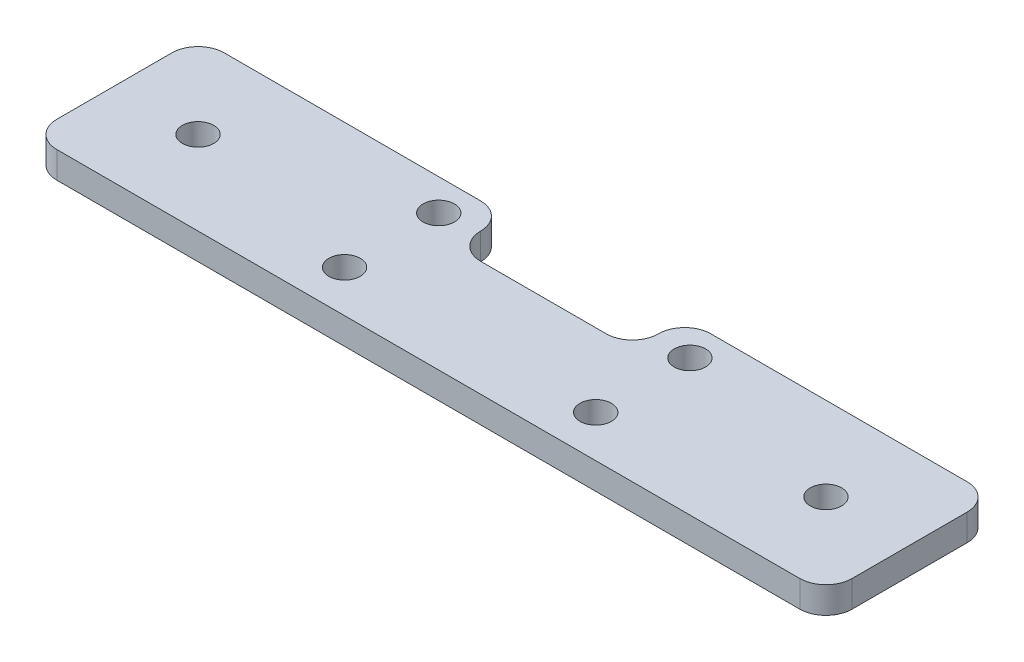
ISO-10303-21;
HEADER;
FILE_DESCRIPTION(('STEP AP214'),'2;1');
FILE_NAME('part.step','',(''),(''),'','','');
FILE_SCHEMA(('AUTOMOTIVE_DESIGN { 1 0 10303 214 1 1 1 1 }'));
ENDSEC;
DATA;
#1=APPLICATION_CONTEXT('core data for automotive mechanical design processes');
#2=APPLICATION_PROTOCOL_DEFINITION('international standard','automotive_design',2000,#1);
#3=PRODUCT_CONTEXT('',#1,'mechanical');
#4=PRODUCT('Part','Part','',(#3));
#5=PRODUCT_RELATED_PRODUCT_CATEGORY('part','',(#4));
#6=PRODUCT_DEFINITION_FORMATION('','',#4);
#7=PRODUCT_DEFINITION_CONTEXT('part definition',#1,'design');
#8=PRODUCT_DEFINITION('design','',#6,#7);
#9=PRODUCT_DEFINITION_SHAPE('','',#8);
#10=(LENGTH_UNIT() NAMED_UNIT(*) SI_UNIT(.MILLI.,.METRE.));
#11=(NAMED_UNIT(*) PLANE_ANGLE_UNIT() SI_UNIT($,.RADIAN.));
#12=(NAMED_UNIT(*) SI_UNIT($,.STERADIAN.) SOLID_ANGLE_UNIT());
#13=UNCERTAINTY_MEASURE_WITH_UNIT(LENGTH_MEASURE(1.E-05),#10,'distance_accuracy_value','');
#14=(GEOMETRIC_REPRESENTATION_CONTEXT(3) GLOBAL_UNCERTAINTY_ASSIGNED_CONTEXT((#13)) GLOBAL_UNIT_ASSIGNED_CONTEXT((#10,
#11,#12)) REPRESENTATION_CONTEXT('',''));
#15=CARTESIAN_POINT('',(0.,0.,0.));
#16=DIRECTION('',(0.,0.,1.));
#17=DIRECTION('',(1.,0.,0.));
#18=AXIS2_PLACEMENT_3D('',#15,#16,#17);
#19=CARTESIAN_POINT('',(0.,2.54,0.));
#20=DIRECTION('',(0.,-1.,0.));
#21=DIRECTION('',(0.,0.,-1.));
#22=AXIS2_PLACEMENT_3D('',#19,#20,#21);
#23=PLANE('',#22);
#24=CARTESIAN_POINT('',(-30.,2.54,0.));
#25=DIRECTION('',(0.,1.,0.));
#26=DIRECTION('',(0.,0.,1.));
#27=AXIS2_PLACEMENT_3D('',#24,#25,#26);
#28=CIRCLE('',#27,1.5);
#29=CARTESIAN_POINT('',(-30.,2.54,1.5));
#30=VERTEX_POINT('',#29);
#31=EDGE_CURVE('E346',#30,#30,#28,.T.);
#32=ORIENTED_EDGE('',*,*,#31,.F.);
#33=EDGE_LOOP('',(#32));
#34=FACE_BOUND('',#33,.T.);
#35=CARTESIAN_POINT('',(12.,2.54,-5.));
#36=DIRECTION('',(0.,1.,0.));
#37=DIRECTION('',(0.,0.,1.));
#38=AXIS2_PLACEMENT_3D('',#35,#36,#37);
#39=CIRCLE('',#38,1.5);
#40=CARTESIAN_POINT('',(12.,2.54,-3.5));
#41=VERTEX_POINT('',#40);
#42=EDGE_CURVE('E334',#41,#41,#39,.T.);
#43=ORIENTED_EDGE('',*,*,#42,.F.);
#44=EDGE_LOOP('',(#43));
#45=FACE_BOUND('',#44,.T.);
#46=CARTESIAN_POINT('',(12.,2.54,4.));
#47=DIRECTION('',(0.,1.,0.));
#48=DIRECTION('',(0.,0.,1.));
#49=AXIS2_PLACEMENT_3D('',#46,#47,#48);
#50=CIRCLE('',#49,1.5);
#51=CARTESIAN_POINT('',(12.,2.54,5.5));
#52=VERTEX_POINT('',#51);
#53=EDGE_CURVE('E240',#52,#52,#50,.T.);
#54=ORIENTED_EDGE('',*,*,#53,.F.);
#55=EDGE_LOOP('',(#54));
#56=FACE_BOUND('',#55,.T.);
#57=DIRECTION('',(-1.,0.,0.));
#58=VECTOR('',#57,1.);
#59=CARTESIAN_POINT('',(-8.5,2.54,-8.));
#60=LINE('',#59,#58);
#61=CARTESIAN_POINT('',(-11.,2.54,-8.));
#62=VERTEX_POINT('',#61);
#63=CARTESIAN_POINT('',(-35.5,2.54,-7.99999999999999));
#64=VERTEX_POINT('',#63);
#65=EDGE_CURVE('E160',#62,#64,#60,.T.);
#66=ORIENTED_EDGE('',*,*,#65,.T.);
#67=CARTESIAN_POINT('',(-35.5,2.54,-5.49999999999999));
#68=DIRECTION('',(0.,-1.,0.));
#69=DIRECTION('',(0.,0.,-1.));
#70=AXIS2_PLACEMENT_3D('',#67,#68,#69);
#71=CIRCLE('',#70,2.5);
#72=CARTESIAN_POINT('',(-38.,2.54,-5.49999999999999));
#73=VERTEX_POINT('',#72);
#74=EDGE_CURVE('E202',#64,#73,#71,.F.);
#75=ORIENTED_EDGE('',*,*,#74,.T.);
#76=DIRECTION('',(0.,0.,1.));
#77=VECTOR('',#76,1.);
#78=CARTESIAN_POINT('',(-38.,2.54,8.00000000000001));
#79=LINE('',#78,#77);
#80=CARTESIAN_POINT('',(-38.,2.54,5.50000000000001));
#81=VERTEX_POINT('',#80);
#82=EDGE_CURVE('E164',#73,#81,#79,.T.);
#83=ORIENTED_EDGE('',*,*,#82,.T.);
#84=CARTESIAN_POINT('',(-35.5,2.54,5.50000000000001));
#85=DIRECTION('',(0.,-1.,0.));
#86=DIRECTION('',(0.,0.,-1.));
#87=AXIS2_PLACEMENT_3D('',#84,#85,#86);
#88=CIRCLE('',#87,2.5);
#89=CARTESIAN_POINT('',(-35.5,2.54,8.00000000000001));
#90=VERTEX_POINT('',#89);
#91=EDGE_CURVE('E200',#81,#90,#88,.F.);
#92=ORIENTED_EDGE('',*,*,#91,.T.);
#93=DIRECTION('',(1.,0.,0.));
#94=VECTOR('',#93,1.);
#95=CARTESIAN_POINT('',(38.,2.54,8.));
#96=LINE('',#95,#94);
#97=CARTESIAN_POINT('',(35.5,2.54,8.));
#98=VERTEX_POINT('',#97);
#99=EDGE_CURVE('E320',#90,#98,#96,.T.);
#100=ORIENTED_EDGE('',*,*,#99,.T.);
#101=CARTESIAN_POINT('',(35.5,2.54,5.5));
#102=DIRECTION('',(0.,-1.,0.));
#103=DIRECTION('',(0.,0.,-1.));
#104=AXIS2_PLACEMENT_3D('',#101,#102,#103);
#105=CIRCLE('',#104,2.5);
#106=CARTESIAN_POINT('',(38.,2.54,5.5));
#107=VERTEX_POINT('',#106);
#108=EDGE_CURVE('E198',#98,#107,#105,.F.);
#109=ORIENTED_EDGE('',*,*,#108,.T.);
#110=DIRECTION('',(0.,0.,-1.));
#111=VECTOR('',#110,1.);
#112=CARTESIAN_POINT('',(38.,2.54,8.));
#113=LINE('',#112,#111);
#114=CARTESIAN_POINT('',(38.,2.54,-5.5));
#115=VERTEX_POINT('',#114);
#116=EDGE_CURVE('E232',#107,#115,#113,.T.);
#117=ORIENTED_EDGE('',*,*,#116,.T.);
#118=CARTESIAN_POINT('',(35.5,2.54,-5.5));
#119=DIRECTION('',(0.,-1.,0.));
#120=DIRECTION('',(0.,0.,-1.));
#121=AXIS2_PLACEMENT_3D('',#118,#119,#120);
#122=CIRCLE('',#121,2.5);
#123=CARTESIAN_POINT('',(35.5,2.54,-8.));
#124=VERTEX_POINT('',#123);
#125=EDGE_CURVE('E196',#115,#124,#122,.F.);
#126=ORIENTED_EDGE('',*,*,#125,.T.);
#127=DIRECTION('',(-1.,0.,0.));
#128=VECTOR('',#127,1.);
#129=CARTESIAN_POINT('',(38.,2.54,-8.));
#130=LINE('',#129,#128);
#131=CARTESIAN_POINT('',(11.,2.54,-8.));
#132=VERTEX_POINT('',#131);
#133=EDGE_CURVE('E230',#124,#132,#130,.T.);
#134=ORIENTED_EDGE('',*,*,#133,.T.);
#135=CARTESIAN_POINT('',(11.,2.54,-5.5));
#136=DIRECTION('',(0.,-1.,0.));
#137=DIRECTION('',(0.,0.,-1.));
#138=AXIS2_PLACEMENT_3D('',#135,#136,#137);
#139=CIRCLE('',#138,2.5);
#140=CARTESIAN_POINT('',(8.5,2.54,-5.5));
#141=VERTEX_POINT('',#140);
#142=EDGE_CURVE('E54',#132,#141,#139,.F.);
#143=ORIENTED_EDGE('',*,*,#142,.T.);
#144=CARTESIAN_POINT('',(6.,2.54,-5.5));
#145=DIRECTION('',(0.,-1.,0.));
#146=DIRECTION('',(0.,0.,-1.));
#147=AXIS2_PLACEMENT_3D('',#144,#145,#146);
#148=CIRCLE('',#147,2.5);
#149=CARTESIAN_POINT('',(6.,2.54,-3.));
#150=VERTEX_POINT('',#149);
#151=EDGE_CURVE('E143',#141,#150,#148,.T.);
#152=ORIENTED_EDGE('',*,*,#151,.T.);
#153=DIRECTION('',(-1.,0.,0.));
#154=VECTOR('',#153,1.);
#155=CARTESIAN_POINT('',(8.5,2.54,-3.));
#156=LINE('',#155,#154);
#157=CARTESIAN_POINT('',(-6.,2.54,-3.));
#158=VERTEX_POINT('',#157);
#159=EDGE_CURVE('E152',#150,#158,#156,.T.);
#160=ORIENTED_EDGE('',*,*,#159,.T.);
#161=CARTESIAN_POINT('',(-6.,2.54,-5.5));
#162=DIRECTION('',(0.,-1.,0.));
#163=DIRECTION('',(0.,0.,-1.));
#164=AXIS2_PLACEMENT_3D('',#161,#162,#163);
#165=CIRCLE('',#164,2.5);
#166=CARTESIAN_POINT('',(-8.5,2.54,-5.5));
#167=VERTEX_POINT('',#166);
#168=EDGE_CURVE('E11',#158,#167,#165,.T.);
#169=ORIENTED_EDGE('',*,*,#168,.T.);
#170=CARTESIAN_POINT('',(-11.,2.54,-5.5));
#171=DIRECTION('',(0.,-1.,0.));
#172=DIRECTION('',(0.,0.,-1.));
#173=AXIS2_PLACEMENT_3D('',#170,#171,#172);
#174=CIRCLE('',#173,2.5);
#175=EDGE_CURVE('E193',#167,#62,#174,.F.);
#176=ORIENTED_EDGE('',*,*,#175,.T.);
#177=EDGE_LOOP('',(#66,#75,#83,#92,#100,#109,#117,#126,#134,#143,#152,#160,#169,#176));
#178=FACE_BOUND('',#177,.T.);
#179=CARTESIAN_POINT('',(-12.,2.54,4.));
#180=DIRECTION('',(0.,1.,0.));
#181=DIRECTION('',(0.,0.,1.));
#182=AXIS2_PLACEMENT_3D('',#179,#180,#181);
#183=CIRCLE('',#182,1.5);
#184=CARTESIAN_POINT('',(-12.,2.54,5.5));
#185=VERTEX_POINT('',#184);
#186=EDGE_CURVE('E328',#185,#185,#183,.T.);
#187=ORIENTED_EDGE('',*,*,#186,.F.);
#188=EDGE_LOOP('',(#187));
#189=FACE_BOUND('',#188,.T.);
#190=CARTESIAN_POINT('',(-12.,2.54,-5.));
#191=DIRECTION('',(0.,1.,0.));
#192=DIRECTION('',(0.,0.,1.));
#193=AXIS2_PLACEMENT_3D('',#190,#191,#192);
#194=CIRCLE('',#193,1.5);
#195=CARTESIAN_POINT('',(-12.,2.54,-3.5));
#196=VERTEX_POINT('',#195);
#197=EDGE_CURVE('E340',#196,#196,#194,.T.);
#198=ORIENTED_EDGE('',*,*,#197,.F.);
#199=EDGE_LOOP('',(#198));
#200=FACE_BOUND('',#199,.T.);
#201=CARTESIAN_POINT('',(30.,2.54,0.));
#202=DIRECTION('',(0.,1.,0.));
#203=DIRECTION('',(0.,0.,1.));
#204=AXIS2_PLACEMENT_3D('',#201,#202,#203);
#205=CIRCLE('',#204,1.5);
#206=CARTESIAN_POINT('',(30.,2.54,1.5));
#207=VERTEX_POINT('',#206);
#208=EDGE_CURVE('E221',#207,#207,#205,.T.);
#209=ORIENTED_EDGE('',*,*,#208,.F.);
#210=EDGE_LOOP('',(#209));
#211=FACE_BOUND('',#210,.T.);
#212=ADVANCED_FACE('F32',(#34,#45,#56,#178,#189,#200,#211),#23,.F.);
#213=CARTESIAN_POINT('',(0.,0.,0.));
#214=DIRECTION('',(0.,-1.,0.));
#215=DIRECTION('',(0.,0.,-1.));
#216=AXIS2_PLACEMENT_3D('',#213,#214,#215);
#217=PLANE('',#216);
#218=CARTESIAN_POINT('',(-30.,0.,0.));
#219=DIRECTION('',(0.,1.,0.));
#220=DIRECTION('',(0.,0.,1.));
#221=AXIS2_PLACEMENT_3D('',#218,#219,#220);
#222=CIRCLE('',#221,1.5);
#223=CARTESIAN_POINT('',(-30.,0.,1.5));
#224=VERTEX_POINT('',#223);
#225=EDGE_CURVE('E349',#224,#224,#222,.T.);
#226=ORIENTED_EDGE('',*,*,#225,.T.);
#227=EDGE_LOOP('',(#226));
#228=FACE_BOUND('',#227,.T.);
#229=CARTESIAN_POINT('',(12.,0.,-5.));
#230=DIRECTION('',(0.,1.,0.));
#231=DIRECTION('',(0.,0.,1.));
#232=AXIS2_PLACEMENT_3D('',#229,#230,#231);
#233=CIRCLE('',#232,1.5);
#234=CARTESIAN_POINT('',(12.,0.,-3.5));
#235=VERTEX_POINT('',#234);
#236=EDGE_CURVE('E337',#235,#235,#233,.T.);
#237=ORIENTED_EDGE('',*,*,#236,.T.);
#238=EDGE_LOOP('',(#237));
#239=FACE_BOUND('',#238,.T.);
#240=CARTESIAN_POINT('',(12.,0.,4.));
#241=DIRECTION('',(0.,1.,0.));
#242=DIRECTION('',(0.,0.,1.));
#243=AXIS2_PLACEMENT_3D('',#240,#241,#242);
#244=CIRCLE('',#243,1.5);
#245=CARTESIAN_POINT('',(12.,0.,5.5));
#246=VERTEX_POINT('',#245);
#247=EDGE_CURVE('E325',#246,#246,#244,.T.);
#248=ORIENTED_EDGE('',*,*,#247,.T.);
#249=EDGE_LOOP('',(#248));
#250=FACE_BOUND('',#249,.T.);
#251=DIRECTION('',(0.,0.,1.));
#252=VECTOR('',#251,1.);
#253=CARTESIAN_POINT('',(-38.,0.,8.00000000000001));
#254=LINE('',#253,#252);
#255=CARTESIAN_POINT('',(-38.,0.,-5.49999999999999));
#256=VERTEX_POINT('',#255);
#257=CARTESIAN_POINT('',(-38.,0.,5.50000000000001));
#258=VERTEX_POINT('',#257);
#259=EDGE_CURVE('E239',#256,#258,#254,.T.);
#260=ORIENTED_EDGE('',*,*,#259,.F.);
#261=CARTESIAN_POINT('',(-35.5,0.,-5.49999999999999));
#262=DIRECTION('',(0.,-1.,0.));
#263=DIRECTION('',(0.,0.,-1.));
#264=AXIS2_PLACEMENT_3D('',#261,#262,#263);
#265=CIRCLE('',#264,2.5);
#266=CARTESIAN_POINT('',(-35.5,0.,-7.99999999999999));
#267=VERTEX_POINT('',#266);
#268=EDGE_CURVE('E186',#256,#267,#265,.T.);
#269=ORIENTED_EDGE('',*,*,#268,.T.);
#270=DIRECTION('',(-1.,0.,0.));
#271=VECTOR('',#270,1.);
#272=CARTESIAN_POINT('',(-8.5,0.,-8.));
#273=LINE('',#272,#271);
#274=CARTESIAN_POINT('',(-11.,0.,-8.));
#275=VERTEX_POINT('',#274);
#276=EDGE_CURVE('E236',#275,#267,#273,.T.);
#277=ORIENTED_EDGE('',*,*,#276,.F.);
#278=CARTESIAN_POINT('',(-11.,0.,-5.5));
#279=DIRECTION('',(0.,-1.,0.));
#280=DIRECTION('',(0.,0.,-1.));
#281=AXIS2_PLACEMENT_3D('',#278,#279,#280);
#282=CIRCLE('',#281,2.5);
#283=CARTESIAN_POINT('',(-8.5,0.,-5.5));
#284=VERTEX_POINT('',#283);
#285=EDGE_CURVE('E176',#275,#284,#282,.T.);
#286=ORIENTED_EDGE('',*,*,#285,.T.);
#287=CARTESIAN_POINT('',(-6.,0.,-5.5));
#288=DIRECTION('',(0.,-1.,0.));
#289=DIRECTION('',(0.,0.,-1.));
#290=AXIS2_PLACEMENT_3D('',#287,#288,#289);
#291=CIRCLE('',#290,2.5);
#292=CARTESIAN_POINT('',(-6.,0.,-3.));
#293=VERTEX_POINT('',#292);
#294=EDGE_CURVE('E41',#284,#293,#291,.F.);
#295=ORIENTED_EDGE('',*,*,#294,.T.);
#296=DIRECTION('',(-1.,0.,0.));
#297=VECTOR('',#296,1.);
#298=CARTESIAN_POINT('',(8.5,0.,-3.));
#299=LINE('',#298,#297);
#300=CARTESIAN_POINT('',(6.,0.,-3.));
#301=VERTEX_POINT('',#300);
#302=EDGE_CURVE('E150',#301,#293,#299,.T.);
#303=ORIENTED_EDGE('',*,*,#302,.F.);
#304=CARTESIAN_POINT('',(6.,0.,-5.5));
#305=DIRECTION('',(0.,-1.,0.));
#306=DIRECTION('',(0.,0.,-1.));
#307=AXIS2_PLACEMENT_3D('',#304,#305,#306);
#308=CIRCLE('',#307,2.5);
#309=CARTESIAN_POINT('',(8.5,0.,-5.5));
#310=VERTEX_POINT('',#309);
#311=EDGE_CURVE('E134',#301,#310,#308,.F.);
#312=ORIENTED_EDGE('',*,*,#311,.T.);
#313=CARTESIAN_POINT('',(11.,0.,-5.5));
#314=DIRECTION('',(0.,-1.,0.));
#315=DIRECTION('',(0.,0.,-1.));
#316=AXIS2_PLACEMENT_3D('',#313,#314,#315);
#317=CIRCLE('',#316,2.5);
#318=CARTESIAN_POINT('',(11.,0.,-8.));
#319=VERTEX_POINT('',#318);
#320=EDGE_CURVE('E178',#310,#319,#317,.T.);
#321=ORIENTED_EDGE('',*,*,#320,.T.);
#322=DIRECTION('',(-1.,0.,0.));
#323=VECTOR('',#322,1.);
#324=CARTESIAN_POINT('',(38.,0.,-8.));
#325=LINE('',#324,#323);
#326=CARTESIAN_POINT('',(35.5,0.,-8.));
#327=VERTEX_POINT('',#326);
#328=EDGE_CURVE('E161',#327,#319,#325,.T.);
#329=ORIENTED_EDGE('',*,*,#328,.F.);
#330=CARTESIAN_POINT('',(35.5,0.,-5.5));
#331=DIRECTION('',(0.,-1.,0.));
#332=DIRECTION('',(0.,0.,-1.));
#333=AXIS2_PLACEMENT_3D('',#330,#331,#332);
#334=CIRCLE('',#333,2.5);
#335=CARTESIAN_POINT('',(38.,0.,-5.5));
#336=VERTEX_POINT('',#335);
#337=EDGE_CURVE('E180',#327,#336,#334,.T.);
#338=ORIENTED_EDGE('',*,*,#337,.T.);
#339=DIRECTION('',(0.,0.,-1.));
#340=VECTOR('',#339,1.);
#341=CARTESIAN_POINT('',(38.,0.,8.));
#342=LINE('',#341,#340);
#343=CARTESIAN_POINT('',(38.,0.,5.5));
#344=VERTEX_POINT('',#343);
#345=EDGE_CURVE('E167',#344,#336,#342,.T.);
#346=ORIENTED_EDGE('',*,*,#345,.F.);
#347=CARTESIAN_POINT('',(35.5,0.,5.5));
#348=DIRECTION('',(0.,-1.,0.));
#349=DIRECTION('',(0.,0.,-1.));
#350=AXIS2_PLACEMENT_3D('',#347,#348,#349);
#351=CIRCLE('',#350,2.5);
#352=CARTESIAN_POINT('',(35.5,0.,8.));
#353=VERTEX_POINT('',#352);
#354=EDGE_CURVE('E182',#344,#353,#351,.T.);
#355=ORIENTED_EDGE('',*,*,#354,.T.);
#356=DIRECTION('',(1.,0.,0.));
#357=VECTOR('',#356,1.);
#358=CARTESIAN_POINT('',(38.,0.,8.));
#359=LINE('',#358,#357);
#360=CARTESIAN_POINT('',(-35.5,0.,8.00000000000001));
#361=VERTEX_POINT('',#360);
#362=EDGE_CURVE('E243',#361,#353,#359,.T.);
#363=ORIENTED_EDGE('',*,*,#362,.F.);
#364=CARTESIAN_POINT('',(-35.5,0.,5.50000000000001));
#365=DIRECTION('',(0.,-1.,0.));
#366=DIRECTION('',(0.,0.,-1.));
#367=AXIS2_PLACEMENT_3D('',#364,#365,#366);
#368=CIRCLE('',#367,2.5);
#369=EDGE_CURVE('E184',#361,#258,#368,.T.);
#370=ORIENTED_EDGE('',*,*,#369,.T.);
#371=EDGE_LOOP('',(#260,#269,#277,#286,#295,#303,#312,#321,#329,#338,#346,#355,#363,#370));
#372=FACE_BOUND('',#371,.T.);
#373=CARTESIAN_POINT('',(-12.,0.,4.));
#374=DIRECTION('',(0.,1.,0.));
#375=DIRECTION('',(0.,0.,1.));
#376=AXIS2_PLACEMENT_3D('',#373,#374,#375);
#377=CIRCLE('',#376,1.5);
#378=CARTESIAN_POINT('',(-12.,0.,5.5));
#379=VERTEX_POINT('',#378);
#380=EDGE_CURVE('E331',#379,#379,#377,.T.);
#381=ORIENTED_EDGE('',*,*,#380,.T.);
#382=EDGE_LOOP('',(#381));
#383=FACE_BOUND('',#382,.T.);
#384=CARTESIAN_POINT('',(-12.,0.,-5.));
#385=DIRECTION('',(0.,1.,0.));
#386=DIRECTION('',(0.,0.,1.));
#387=AXIS2_PLACEMENT_3D('',#384,#385,#386);
#388=CIRCLE('',#387,1.5);
#389=CARTESIAN_POINT('',(-12.,0.,-3.5));
#390=VERTEX_POINT('',#389);
#391=EDGE_CURVE('E343',#390,#390,#388,.T.);
#392=ORIENTED_EDGE('',*,*,#391,.T.);
#393=EDGE_LOOP('',(#392));
#394=FACE_BOUND('',#393,.T.);
#395=CARTESIAN_POINT('',(30.,0.,0.));
#396=DIRECTION('',(0.,1.,0.));
#397=DIRECTION('',(0.,0.,1.));
#398=AXIS2_PLACEMENT_3D('',#395,#396,#397);
#399=CIRCLE('',#398,1.5);
#400=CARTESIAN_POINT('',(30.,0.,1.5));
#401=VERTEX_POINT('',#400);
#402=EDGE_CURVE('E219',#401,#401,#399,.T.);
#403=ORIENTED_EDGE('',*,*,#402,.T.);
#404=EDGE_LOOP('',(#403));
#405=FACE_BOUND('',#404,.T.);
#406=ADVANCED_FACE('F157',(#228,#239,#250,#372,#383,#394,#405),#217,.T.);
#407=CARTESIAN_POINT('',(-8.5,2.54,-8.));
#408=DIRECTION('',(0.,0.,1.));
#409=DIRECTION('',(1.,0.,0.));
#410=AXIS2_PLACEMENT_3D('',#407,#408,#409);
#411=PLANE('',#410);
#412=ORIENTED_EDGE('',*,*,#276,.T.);
#413=DIRECTION('',(0.,-1.,0.));
#414=VECTOR('',#413,1.);
#415=CARTESIAN_POINT('',(-35.5,2.54,-7.99999999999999));
#416=LINE('',#415,#414);
#417=EDGE_CURVE('E191',#267,#64,#416,.F.);
#418=ORIENTED_EDGE('',*,*,#417,.T.);
#419=ORIENTED_EDGE('',*,*,#65,.F.);
#420=DIRECTION('',(0.,-1.,0.));
#421=VECTOR('',#420,1.);
#422=CARTESIAN_POINT('',(-11.,2.54,-8.));
#423=LINE('',#422,#421);
#424=EDGE_CURVE('E188',#62,#275,#423,.T.);
#425=ORIENTED_EDGE('',*,*,#424,.T.);
#426=EDGE_LOOP('',(#412,#418,#419,#425));
#427=FACE_BOUND('',#426,.T.);
#428=ADVANCED_FACE('F283',(#427),#411,.F.);
#429=CARTESIAN_POINT('',(-38.,2.54,8.00000000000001));
#430=DIRECTION('',(1.,0.,0.));
#431=DIRECTION('',(0.,0.,-1.));
#432=AXIS2_PLACEMENT_3D('',#429,#430,#431);
#433=PLANE('',#432);
#434=ORIENTED_EDGE('',*,*,#82,.F.);
#435=DIRECTION('',(0.,-1.,0.));
#436=VECTOR('',#435,1.);
#437=CARTESIAN_POINT('',(-38.,2.54,-5.49999999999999));
#438=LINE('',#437,#436);
#439=EDGE_CURVE('E173',#73,#256,#438,.T.);
#440=ORIENTED_EDGE('',*,*,#439,.T.);
#441=ORIENTED_EDGE('',*,*,#259,.T.);
#442=DIRECTION('',(0.,-1.,0.));
#443=VECTOR('',#442,1.);
#444=CARTESIAN_POINT('',(-38.,2.54,5.50000000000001));
#445=LINE('',#444,#443);
#446=EDGE_CURVE('E153',#258,#81,#445,.F.);
#447=ORIENTED_EDGE('',*,*,#446,.T.);
#448=EDGE_LOOP('',(#434,#440,#441,#447));
#449=FACE_BOUND('',#448,.T.);
#450=ADVANCED_FACE('F301',(#449),#433,.F.);
#451=CARTESIAN_POINT('',(38.,2.54,8.));
#452=DIRECTION('',(0.,0.,-1.));
#453=DIRECTION('',(-1.,0.,0.));
#454=AXIS2_PLACEMENT_3D('',#451,#452,#453);
#455=PLANE('',#454);
#456=ORIENTED_EDGE('',*,*,#99,.F.);
#457=DIRECTION('',(0.,-1.,0.));
#458=VECTOR('',#457,1.);
#459=CARTESIAN_POINT('',(-35.5,2.54,8.00000000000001));
#460=LINE('',#459,#458);
#461=EDGE_CURVE('E206',#90,#361,#460,.T.);
#462=ORIENTED_EDGE('',*,*,#461,.T.);
#463=ORIENTED_EDGE('',*,*,#362,.T.);
#464=DIRECTION('',(0.,-1.,0.));
#465=VECTOR('',#464,1.);
#466=CARTESIAN_POINT('',(35.5,2.54,8.));
#467=LINE('',#466,#465);
#468=EDGE_CURVE('E204',#353,#98,#467,.F.);
#469=ORIENTED_EDGE('',*,*,#468,.T.);
#470=EDGE_LOOP('',(#456,#462,#463,#469));
#471=FACE_BOUND('',#470,.T.);
#472=ADVANCED_FACE('F298',(#471),#455,.F.);
#473=CARTESIAN_POINT('',(38.,2.54,8.));
#474=DIRECTION('',(-1.,0.,0.));
#475=DIRECTION('',(0.,0.,1.));
#476=AXIS2_PLACEMENT_3D('',#473,#474,#475);
#477=PLANE('',#476);
#478=ORIENTED_EDGE('',*,*,#116,.F.);
#479=DIRECTION('',(0.,-1.,0.));
#480=VECTOR('',#479,1.);
#481=CARTESIAN_POINT('',(38.,2.54,5.5));
#482=LINE('',#481,#480);
#483=EDGE_CURVE('E211',#107,#344,#482,.T.);
#484=ORIENTED_EDGE('',*,*,#483,.T.);
#485=ORIENTED_EDGE('',*,*,#345,.T.);
#486=DIRECTION('',(0.,-1.,0.));
#487=VECTOR('',#486,1.);
#488=CARTESIAN_POINT('',(38.,2.54,-5.5));
#489=LINE('',#488,#487);
#490=EDGE_CURVE('E209',#336,#115,#489,.F.);
#491=ORIENTED_EDGE('',*,*,#490,.T.);
#492=EDGE_LOOP('',(#478,#484,#485,#491));
#493=FACE_BOUND('',#492,.T.);
#494=ADVANCED_FACE('F250',(#493),#477,.F.);
#495=CARTESIAN_POINT('',(38.,2.54,-8.));
#496=DIRECTION('',(0.,0.,1.));
#497=DIRECTION('',(1.,0.,0.));
#498=AXIS2_PLACEMENT_3D('',#495,#496,#497);
#499=PLANE('',#498);
#500=ORIENTED_EDGE('',*,*,#133,.F.);
#501=DIRECTION('',(0.,-1.,0.));
#502=VECTOR('',#501,1.);
#503=CARTESIAN_POINT('',(35.5,2.54,-8.));
#504=LINE('',#503,#502);
#505=EDGE_CURVE('E144',#124,#327,#504,.T.);
#506=ORIENTED_EDGE('',*,*,#505,.T.);
#507=ORIENTED_EDGE('',*,*,#328,.T.);
#508=DIRECTION('',(0.,-1.,0.));
#509=VECTOR('',#508,1.);
#510=CARTESIAN_POINT('',(11.,2.54,-8.));
#511=LINE('',#510,#509);
#512=EDGE_CURVE('E214',#319,#132,#511,.F.);
#513=ORIENTED_EDGE('',*,*,#512,.T.);
#514=EDGE_LOOP('',(#500,#506,#507,#513));
#515=FACE_BOUND('',#514,.T.);
#516=ADVANCED_FACE('F259',(#515),#499,.F.);
#517=CARTESIAN_POINT('',(8.5,2.54,-3.));
#518=DIRECTION('',(0.,0.,1.));
#519=DIRECTION('',(1.,0.,0.));
#520=AXIS2_PLACEMENT_3D('',#517,#518,#519);
#521=PLANE('',#520);
#522=ORIENTED_EDGE('',*,*,#159,.F.);
#523=DIRECTION('',(0.,-1.,0.));
#524=VECTOR('',#523,1.);
#525=CARTESIAN_POINT('',(6.,0.,-3.));
#526=LINE('',#525,#524);
#527=EDGE_CURVE('E138',#150,#301,#526,.T.);
#528=ORIENTED_EDGE('',*,*,#527,.T.);
#529=ORIENTED_EDGE('',*,*,#302,.T.);
#530=DIRECTION('',(0.,-1.,0.));
#531=VECTOR('',#530,1.);
#532=CARTESIAN_POINT('',(-6.,2.54,-3.));
#533=LINE('',#532,#531);
#534=EDGE_CURVE('E154',#293,#158,#533,.F.);
#535=ORIENTED_EDGE('',*,*,#534,.T.);
#536=EDGE_LOOP('',(#522,#528,#529,#535));
#537=FACE_BOUND('',#536,.T.);
#538=ADVANCED_FACE('F149',(#537),#521,.F.);
#539=CARTESIAN_POINT('',(12.,2.54,4.));
#540=DIRECTION('',(0.,-1.,0.));
#541=DIRECTION('',(0.,0.,-1.));
#542=AXIS2_PLACEMENT_3D('',#539,#540,#541);
#543=CYLINDRICAL_SURFACE('',#542,1.5);
#544=ORIENTED_EDGE('',*,*,#53,.T.);
#545=EDGE_LOOP('',(#544));
#546=FACE_BOUND('',#545,.T.);
#547=ORIENTED_EDGE('',*,*,#247,.F.);
#548=EDGE_LOOP('',(#547));
#549=FACE_BOUND('',#548,.T.);
#550=ADVANCED_FACE('F289',(#546,#549),#543,.F.);
#551=CARTESIAN_POINT('',(-12.,2.54,4.));
#552=DIRECTION('',(0.,-1.,0.));
#553=DIRECTION('',(0.,0.,-1.));
#554=AXIS2_PLACEMENT_3D('',#551,#552,#553);
#555=CYLINDRICAL_SURFACE('',#554,1.5);
#556=ORIENTED_EDGE('',*,*,#186,.T.);
#557=EDGE_LOOP('',(#556));
#558=FACE_BOUND('',#557,.T.);
#559=ORIENTED_EDGE('',*,*,#380,.F.);
#560=EDGE_LOOP('',(#559));
#561=FACE_BOUND('',#560,.T.);
#562=ADVANCED_FACE('F372',(#558,#561),#555,.F.);
#563=CARTESIAN_POINT('',(12.,2.54,-5.));
#564=DIRECTION('',(0.,-1.,0.));
#565=DIRECTION('',(0.,0.,-1.));
#566=AXIS2_PLACEMENT_3D('',#563,#564,#565);
#567=CYLINDRICAL_SURFACE('',#566,1.5);
#568=ORIENTED_EDGE('',*,*,#42,.T.);
#569=EDGE_LOOP('',(#568));
#570=FACE_BOUND('',#569,.T.);
#571=ORIENTED_EDGE('',*,*,#236,.F.);
#572=EDGE_LOOP('',(#571));
#573=FACE_BOUND('',#572,.T.);
#574=ADVANCED_FACE('F377',(#570,#573),#567,.F.);
#575=CARTESIAN_POINT('',(-12.,2.54,-5.));
#576=DIRECTION('',(0.,-1.,0.));
#577=DIRECTION('',(0.,0.,-1.));
#578=AXIS2_PLACEMENT_3D('',#575,#576,#577);
#579=CYLINDRICAL_SURFACE('',#578,1.5);
#580=ORIENTED_EDGE('',*,*,#197,.T.);
#581=EDGE_LOOP('',(#580));
#582=FACE_BOUND('',#581,.T.);
#583=ORIENTED_EDGE('',*,*,#391,.F.);
#584=EDGE_LOOP('',(#583));
#585=FACE_BOUND('',#584,.T.);
#586=ADVANCED_FACE('F363',(#582,#585),#579,.F.);
#587=CARTESIAN_POINT('',(-30.,2.54,0.));
#588=DIRECTION('',(0.,-1.,0.));
#589=DIRECTION('',(0.,0.,-1.));
#590=AXIS2_PLACEMENT_3D('',#587,#588,#589);
#591=CYLINDRICAL_SURFACE('',#590,1.5);
#592=ORIENTED_EDGE('',*,*,#31,.T.);
#593=EDGE_LOOP('',(#592));
#594=FACE_BOUND('',#593,.T.);
#595=ORIENTED_EDGE('',*,*,#225,.F.);
#596=EDGE_LOOP('',(#595));
#597=FACE_BOUND('',#596,.T.);
#598=ADVANCED_FACE('F273',(#594,#597),#591,.F.);
#599=CARTESIAN_POINT('',(30.,2.54,0.));
#600=DIRECTION('',(0.,-1.,0.));
#601=DIRECTION('',(0.,0.,-1.));
#602=AXIS2_PLACEMENT_3D('',#599,#600,#601);
#603=CYLINDRICAL_SURFACE('',#602,1.5);
#604=ORIENTED_EDGE('',*,*,#208,.T.);
#605=EDGE_LOOP('',(#604));
#606=FACE_BOUND('',#605,.T.);
#607=ORIENTED_EDGE('',*,*,#402,.F.);
#608=EDGE_LOOP('',(#607));
#609=FACE_BOUND('',#608,.T.);
#610=ADVANCED_FACE('F265',(#606,#609),#603,.F.);
#611=CARTESIAN_POINT('',(11.,2.54,-5.5));
#612=DIRECTION('',(0.,-1.,0.));
#613=DIRECTION('',(0.,0.,-1.));
#614=AXIS2_PLACEMENT_3D('',#611,#612,#613);
#615=CYLINDRICAL_SURFACE('',#614,2.5);
#616=DIRECTION('',(0.,-1.,0.));
#617=VECTOR('',#616,1.);
#618=CARTESIAN_POINT('',(8.5,2.54,-5.5));
#619=LINE('',#618,#617);
#620=EDGE_CURVE('E139',#141,#310,#619,.T.);
#621=ORIENTED_EDGE('',*,*,#620,.F.);
#622=ORIENTED_EDGE('',*,*,#142,.F.);
#623=ORIENTED_EDGE('',*,*,#512,.F.);
#624=ORIENTED_EDGE('',*,*,#320,.F.);
#625=EDGE_LOOP('',(#621,#622,#623,#624));
#626=FACE_BOUND('',#625,.T.);
#627=ADVANCED_FACE('F263',(#626),#615,.T.);
#628=CARTESIAN_POINT('',(6.,2.54,-5.5));
#629=DIRECTION('',(0.,1.,0.));
#630=DIRECTION('',(0.,0.,1.));
#631=AXIS2_PLACEMENT_3D('',#628,#629,#630);
#632=CYLINDRICAL_SURFACE('',#631,2.5);
#633=ORIENTED_EDGE('',*,*,#151,.F.);
#634=ORIENTED_EDGE('',*,*,#620,.T.);
#635=ORIENTED_EDGE('',*,*,#311,.F.);
#636=ORIENTED_EDGE('',*,*,#527,.F.);
#637=EDGE_LOOP('',(#633,#634,#635,#636));
#638=FACE_BOUND('',#637,.T.);
#639=ADVANCED_FACE('F137',(#638),#632,.F.);
#640=CARTESIAN_POINT('',(-35.5,2.54,-5.49999999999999));
#641=DIRECTION('',(0.,-1.,0.));
#642=DIRECTION('',(0.,0.,-1.));
#643=AXIS2_PLACEMENT_3D('',#640,#641,#642);
#644=CYLINDRICAL_SURFACE('',#643,2.5);
#645=ORIENTED_EDGE('',*,*,#74,.F.);
#646=ORIENTED_EDGE('',*,*,#417,.F.);
#647=ORIENTED_EDGE('',*,*,#268,.F.);
#648=ORIENTED_EDGE('',*,*,#439,.F.);
#649=EDGE_LOOP('',(#645,#646,#647,#648));
#650=FACE_BOUND('',#649,.T.);
#651=ADVANCED_FACE('F271',(#650),#644,.T.);
#652=CARTESIAN_POINT('',(-35.5,2.54,5.50000000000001));
#653=DIRECTION('',(0.,-1.,0.));
#654=DIRECTION('',(0.,0.,-1.));
#655=AXIS2_PLACEMENT_3D('',#652,#653,#654);
#656=CYLINDRICAL_SURFACE('',#655,2.5);
#657=ORIENTED_EDGE('',*,*,#91,.F.);
#658=ORIENTED_EDGE('',*,*,#446,.F.);
#659=ORIENTED_EDGE('',*,*,#369,.F.);
#660=ORIENTED_EDGE('',*,*,#461,.F.);
#661=EDGE_LOOP('',(#657,#658,#659,#660));
#662=FACE_BOUND('',#661,.T.);
#663=ADVANCED_FACE('F471',(#662),#656,.T.);
#664=CARTESIAN_POINT('',(35.5,2.54,5.5));
#665=DIRECTION('',(0.,-1.,0.));
#666=DIRECTION('',(0.,0.,-1.));
#667=AXIS2_PLACEMENT_3D('',#664,#665,#666);
#668=CYLINDRICAL_SURFACE('',#667,2.5);
#669=ORIENTED_EDGE('',*,*,#108,.F.);
#670=ORIENTED_EDGE('',*,*,#468,.F.);
#671=ORIENTED_EDGE('',*,*,#354,.F.);
#672=ORIENTED_EDGE('',*,*,#483,.F.);
#673=EDGE_LOOP('',(#669,#670,#671,#672));
#674=FACE_BOUND('',#673,.T.);
#675=ADVANCED_FACE('F479',(#674),#668,.T.);
#676=CARTESIAN_POINT('',(35.5,2.54,-5.5));
#677=DIRECTION('',(0.,-1.,0.));
#678=DIRECTION('',(0.,0.,-1.));
#679=AXIS2_PLACEMENT_3D('',#676,#677,#678);
#680=CYLINDRICAL_SURFACE('',#679,2.5);
#681=ORIENTED_EDGE('',*,*,#125,.F.);
#682=ORIENTED_EDGE('',*,*,#490,.F.);
#683=ORIENTED_EDGE('',*,*,#337,.F.);
#684=ORIENTED_EDGE('',*,*,#505,.F.);
#685=EDGE_LOOP('',(#681,#682,#683,#684));
#686=FACE_BOUND('',#685,.T.);
#687=ADVANCED_FACE('F255',(#686),#680,.T.);
#688=CARTESIAN_POINT('',(-6.,2.54,-5.5));
#689=DIRECTION('',(0.,1.,0.));
#690=DIRECTION('',(0.,0.,1.));
#691=AXIS2_PLACEMENT_3D('',#688,#689,#690);
#692=CYLINDRICAL_SURFACE('',#691,2.5);
#693=DIRECTION('',(0.,-1.,0.));
#694=VECTOR('',#693,1.);
#695=CARTESIAN_POINT('',(-8.5,0.,-5.5));
#696=LINE('',#695,#694);
#697=EDGE_CURVE('E36',#167,#284,#696,.T.);
#698=ORIENTED_EDGE('',*,*,#697,.F.);
#699=ORIENTED_EDGE('',*,*,#168,.F.);
#700=ORIENTED_EDGE('',*,*,#534,.F.);
#701=ORIENTED_EDGE('',*,*,#294,.F.);
#702=EDGE_LOOP('',(#698,#699,#700,#701));
#703=FACE_BOUND('',#702,.T.);
#704=ADVANCED_FACE('F34',(#703),#692,.F.);
#705=CARTESIAN_POINT('',(-11.,2.54,-5.5));
#706=DIRECTION('',(0.,-1.,0.));
#707=DIRECTION('',(0.,0.,-1.));
#708=AXIS2_PLACEMENT_3D('',#705,#706,#707);
#709=CYLINDRICAL_SURFACE('',#708,2.5);
#710=ORIENTED_EDGE('',*,*,#175,.F.);
#711=ORIENTED_EDGE('',*,*,#697,.T.);
#712=ORIENTED_EDGE('',*,*,#285,.F.);
#713=ORIENTED_EDGE('',*,*,#424,.F.);
#714=EDGE_LOOP('',(#710,#711,#712,#713));
#715=FACE_BOUND('',#714,.T.);
#716=ADVANCED_FACE('F226',(#715),#709,.T.);
#717=CLOSED_SHELL('',(#212,#406,#428,#450,#472,#494,#516,#538,#550,#562,#574,#586,#598,#610,
#627,#639,#651,#663,#675,#687,#704,#716));
#718=MANIFOLD_SOLID_BREP('B2',#717);
#719=ADVANCED_BREP_SHAPE_REPRESENTATION('',(#18,#718),#14);
#720=SHAPE_DEFINITION_REPRESENTATION(#9,#719);
ENDSEC;
END-ISO-10303-21;
